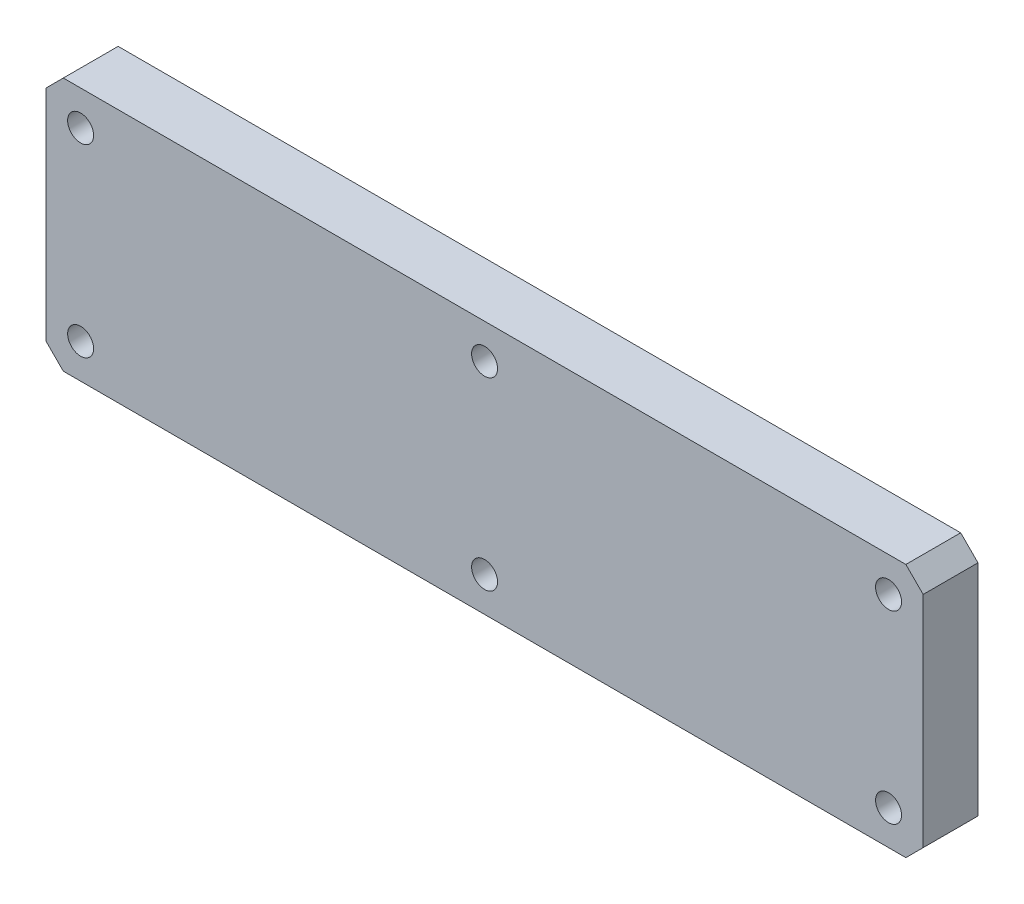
from build123d import *

# Parameters (mm, degrees)
SKETCH_1_W                         = 152
SKETCH_1_H                         = 44
EXTRUDE_1_DEPTH                    = 9.5
SKETCH_2_R                         = 2.25
CUT_EXTRUDE_1_DEPTH                = 159.525234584
CHAMFER_1_SIZE                     = 2.05
PATTERN_LINEAR_1_COUNT             = 3
PATTERN_LINEAR_1_PITCH             = 70
PATTERN_LINEAR_1_COUNT_DIR2        = 2
PATTERN_LINEAR_1_PITCH_DIR2        = 32
CHAMFER_1_OF_PATTERN_LINEAR_1_SIZE = 2.05
CHAMFER_2_SIZE                     = 3


with BuildPart() as part:
    # Sketch 1 → Extrude 1 (new body)
    with BuildSketch(Plane.XY):
        with Locations((76, 22)):
            Rectangle(SKETCH_1_W, SKETCH_1_H)
    extrude(amount=EXTRUDE_1_DEPTH)

    # Sketch 2 → Cut-Extrude 1 (cut, through all)
    with BuildSketch(Plane(origin=(0, 0, 0), x_dir=(-1, 0, 0), z_dir=(0, 0, -1))):
        with Locations((-146, 38)):
            Circle(SKETCH_2_R)
    cut_extrude_1 = extrude(amount=-CUT_EXTRUDE_1_DEPTH, mode=Mode.SUBTRACT)

    # Chamfer 1
    chamfer_1_edges = [part.edges().sort_by_distance(p)[0] for p in [
        (148.25, 38, 0),
    ]]
    chamfer(chamfer_1_edges, length=CHAMFER_1_SIZE)

    # Pattern Linear 1: Cut-Extrude 1 3 × 2
    with Locations(*[(-i * PATTERN_LINEAR_1_PITCH, -j * PATTERN_LINEAR_1_PITCH_DIR2, 0) for i in range(PATTERN_LINEAR_1_COUNT) for j in range(PATTERN_LINEAR_1_COUNT_DIR2) if (i, j) != (0, 0)]):
        add(cut_extrude_1, mode=Mode.SUBTRACT)

    # Chamfer 1 of Pattern Linear 1
    chamfer_1_of_pattern_linear_1_edges = [part.edges().sort_by_distance(p)[0] for p in [
        (148.25, 6, 0),
        (78.25, 38, 0),
        (78.25, 6, 0),
        (8.25, 38, 0),
        (8.25, 6, 0),
    ]]
    chamfer(chamfer_1_of_pattern_linear_1_edges, length=CHAMFER_1_OF_PATTERN_LINEAR_1_SIZE)

    # Chamfer 2
    chamfer_2_edges = [part.edges().sort_by_distance(p)[0] for p in [
        (0, 44, 4.75),
        (152, 44, 4.75),
        (152, 0, 4.75),
        (0, 0, 4.75),
    ]]
    chamfer(chamfer_2_edges, length=CHAMFER_2_SIZE)


solid = part.part
